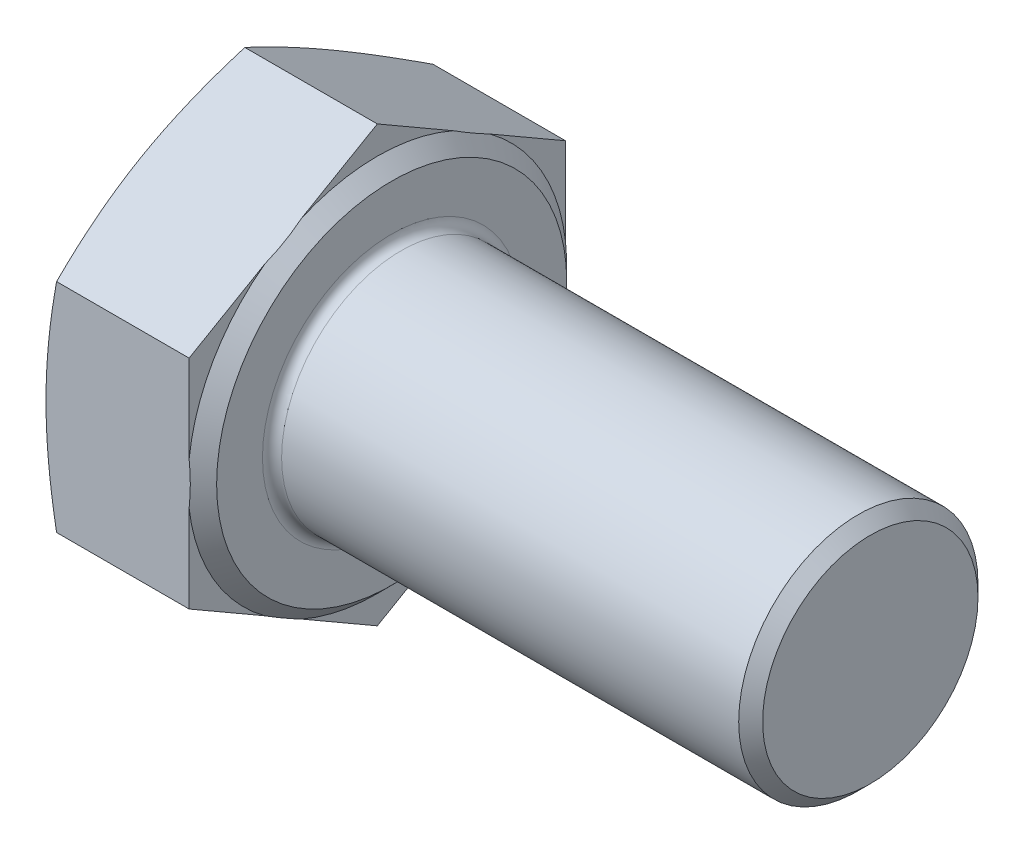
ISO-10303-21;
HEADER;
FILE_DESCRIPTION(('STEP AP214'),'2;1');
FILE_NAME('part.step','',(''),(''),'','','');
FILE_SCHEMA(('AUTOMOTIVE_DESIGN { 1 0 10303 214 1 1 1 1 }'));
ENDSEC;
DATA;
#1=APPLICATION_CONTEXT('core data for automotive mechanical design processes');
#2=APPLICATION_PROTOCOL_DEFINITION('international standard','automotive_design',2000,#1);
#3=PRODUCT_CONTEXT('',#1,'mechanical');
#4=PRODUCT('Part','Part','',(#3));
#5=PRODUCT_RELATED_PRODUCT_CATEGORY('part','',(#4));
#6=PRODUCT_DEFINITION_FORMATION('','',#4);
#7=PRODUCT_DEFINITION_CONTEXT('part definition',#1,'design');
#8=PRODUCT_DEFINITION('design','',#6,#7);
#9=PRODUCT_DEFINITION_SHAPE('','',#8);
#10=(LENGTH_UNIT() NAMED_UNIT(*) SI_UNIT(.MILLI.,.METRE.));
#11=(NAMED_UNIT(*) PLANE_ANGLE_UNIT() SI_UNIT($,.RADIAN.));
#12=(NAMED_UNIT(*) SI_UNIT($,.STERADIAN.) SOLID_ANGLE_UNIT());
#13=UNCERTAINTY_MEASURE_WITH_UNIT(LENGTH_MEASURE(1.E-05),#10,'distance_accuracy_value','');
#14=(GEOMETRIC_REPRESENTATION_CONTEXT(3) GLOBAL_UNCERTAINTY_ASSIGNED_CONTEXT((#13)) GLOBAL_UNIT_ASSIGNED_CONTEXT((#10,
#11,#12)) REPRESENTATION_CONTEXT('',''));
#15=CARTESIAN_POINT('',(0.,0.,0.));
#16=DIRECTION('',(0.,0.,1.));
#17=DIRECTION('',(1.,0.,0.));
#18=AXIS2_PLACEMENT_3D('',#15,#16,#17);
#19=CARTESIAN_POINT('',(6.58,-13.6225796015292,7.865));
#20=DIRECTION('',(-1.,0.,0.));
#21=DIRECTION('',(0.,0.,1.));
#22=AXIS2_PLACEMENT_3D('',#19,#20,#21);
#23=PLANE('',#22);
#24=CARTESIAN_POINT('',(6.58,0.,0.));
#25=DIRECTION('',(-1.,0.,0.));
#26=DIRECTION('',(0.,0.,1.));
#27=AXIS2_PLACEMENT_3D('',#24,#25,#26);
#28=CIRCLE('',#27,5.4);
#29=CARTESIAN_POINT('',(6.58,0.,5.4));
#30=VERTEX_POINT('',#29);
#31=EDGE_CURVE('E11',#30,#30,#28,.T.);
#32=ORIENTED_EDGE('',*,*,#31,.T.);
#33=EDGE_LOOP('',(#32));
#34=FACE_BOUND('',#33,.T.);
#35=CARTESIAN_POINT('',(6.58,0.,0.));
#36=DIRECTION('',(-1.,0.,0.));
#37=DIRECTION('',(0.,0.,1.));
#38=AXIS2_PLACEMENT_3D('',#35,#36,#37);
#39=CIRCLE('',#38,7.315);
#40=CARTESIAN_POINT('',(6.58,0.,7.315));
#41=VERTEX_POINT('',#40);
#42=EDGE_CURVE('E394',#41,#41,#39,.T.);
#43=ORIENTED_EDGE('',*,*,#42,.F.);
#44=EDGE_LOOP('',(#43));
#45=FACE_BOUND('',#44,.T.);
#46=ADVANCED_FACE('F34',(#34,#45),#23,.F.);
#47=CARTESIAN_POINT('',(6.58,-9.08171973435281,0.));
#48=DIRECTION('',(0.,0.866025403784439,0.5));
#49=DIRECTION('',(0.,-0.5,0.866025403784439));
#50=AXIS2_PLACEMENT_3D('',#47,#48,#49);
#51=PLANE('',#50);
#52=CARTESIAN_POINT('',(0.442891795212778,-4.54074439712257,-7.8652));
#53=CARTESIAN_POINT('',(0.374419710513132,-4.72880090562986,-7.53947657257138));
#54=CARTESIAN_POINT('',(0.31213253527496,-4.91747753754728,-7.21267905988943));
#55=CARTESIAN_POINT('',(0.202547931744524,-5.2960575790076,-6.55695919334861));
#56=CARTESIAN_POINT('',(0.155262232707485,-5.48596183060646,-6.22803538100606));
#57=CARTESIAN_POINT('',(0.0787789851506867,-5.86488964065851,-5.57171316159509));
#58=CARTESIAN_POINT('',(0.0494146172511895,-6.05390454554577,-5.24432974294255));
#59=CARTESIAN_POINT('',(0.0100287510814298,-6.43237636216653,-4.58879732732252));
#60=CARTESIAN_POINT('',(0.,-6.62183308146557,-4.26064866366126));
#61=CARTESIAN_POINT('',(0.,-7.00074652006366,-3.60435133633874));
#62=CARTESIAN_POINT('',(0.01002875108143,-7.1902032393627,-3.27620267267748));
#63=CARTESIAN_POINT('',(0.0494146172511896,-7.56867505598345,-2.62067025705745));
#64=CARTESIAN_POINT('',(0.0787789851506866,-7.75768996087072,-2.29328683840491));
#65=CARTESIAN_POINT('',(0.155262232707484,-8.13661777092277,-1.63696461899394));
#66=CARTESIAN_POINT('',(0.202547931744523,-8.32652202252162,-1.30804080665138));
#67=CARTESIAN_POINT('',(0.31213253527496,-8.70510206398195,-0.652320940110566));
#68=CARTESIAN_POINT('',(0.374419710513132,-8.89377869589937,-0.325523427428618));
#69=CARTESIAN_POINT('',(0.442891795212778,-9.08183520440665,0.000200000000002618));
#70=B_SPLINE_CURVE_WITH_KNOTS('',3,(#52,#53,#54,#55,#56,#57,#58,#59,#60,#61,#62,#63,#64,#65,#66,
#67,#68,#69),.UNSPECIFIED.,.F.,.F.,(4,2,2,2,2,2,2,2,4),(0.,1.14700314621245,2.29490090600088,
3.43194374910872,4.56856000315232,5.70517625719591,6.84221910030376,7.99011686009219,
9.13712000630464),.UNSPECIFIED.);
#71=CARTESIAN_POINT('',(0.442849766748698,-4.54085986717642,-7.865));
#72=VERTEX_POINT('',#71);
#73=CARTESIAN_POINT('',(0.,-6.81128980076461,-3.9325));
#74=VERTEX_POINT('',#73);
#75=EDGE_CURVE('E150',#72,#74,#70,.T.);
#76=ORIENTED_EDGE('',*,*,#75,.F.);
#77=DIRECTION('',(-1.,0.,0.));
#78=VECTOR('',#77,1.);
#79=CARTESIAN_POINT('',(6.58,-4.54085986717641,-7.865));
#80=LINE('',#79,#78);
#81=CARTESIAN_POINT('',(5.98,-4.54085986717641,-7.865));
#82=VERTEX_POINT('',#81);
#83=EDGE_CURVE('E179',#82,#72,#80,.T.);
#84=ORIENTED_EDGE('',*,*,#83,.F.);
#85=DIRECTION('',(0.,0.5,-0.866025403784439));
#86=VECTOR('',#85,1.);
#87=CARTESIAN_POINT('',(5.98,-9.08171973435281,0.));
#88=LINE('',#87,#86);
#89=CARTESIAN_POINT('',(5.98,-6.36716144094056,-4.7017528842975));
#90=VERTEX_POINT('',#89);
#91=EDGE_CURVE('E360',#90,#82,#88,.T.);
#92=ORIENTED_EDGE('',*,*,#91,.F.);
#93=CARTESIAN_POINT('',(5.9798,-7.25630835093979,-3.16170526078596));
#94=CARTESIAN_POINT('',(5.99646670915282,-7.18233435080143,-3.2898319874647));
#95=CARTESIAN_POINT('',(6.00903010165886,-7.10812502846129,-3.41836630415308));
#96=CARTESIAN_POINT('',(6.02578356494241,-6.95970657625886,-3.67543460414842));
#97=CARTESIAN_POINT('',(6.03,-6.88549818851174,-3.80396730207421));
#98=CARTESIAN_POINT('',(6.03,-6.73708141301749,-4.06103269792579));
#99=CARTESIAN_POINT('',(6.02578356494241,-6.66287302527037,-4.18956539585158));
#100=CARTESIAN_POINT('',(6.00903010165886,-6.51445457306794,-4.44663369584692));
#101=CARTESIAN_POINT('',(5.99646670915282,-6.44024525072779,-4.5751680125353));
#102=CARTESIAN_POINT('',(5.9798,-6.36627125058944,-4.70329473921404));
#103=B_SPLINE_CURVE_WITH_KNOTS('',3,(#93,#94,#95,#96,#97,#98,#99,#100,#101,#102),.UNSPECIFIED.,
.F.,.F.,(4,2,2,2,4),(0.,0.446607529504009,0.891802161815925,1.33699679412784,1.78360432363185),.UNSPECIFIED.);
#104=CARTESIAN_POINT('',(5.98,-7.25541816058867,-3.1632471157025));
#105=VERTEX_POINT('',#104);
#106=EDGE_CURVE('E298',#105,#90,#103,.T.);
#107=ORIENTED_EDGE('',*,*,#106,.F.);
#108=CARTESIAN_POINT('',(5.98,-9.08171973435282,0.));
#109=VERTEX_POINT('',#108);
#110=EDGE_CURVE('E364',#109,#105,#88,.T.);
#111=ORIENTED_EDGE('',*,*,#110,.F.);
#112=DIRECTION('',(-1.,0.,0.));
#113=VECTOR('',#112,1.);
#114=CARTESIAN_POINT('',(6.58,-9.08171973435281,0.));
#115=LINE('',#114,#113);
#116=CARTESIAN_POINT('',(0.442849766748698,-9.08171973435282,0.));
#117=VERTEX_POINT('',#116);
#118=EDGE_CURVE('E173',#109,#117,#115,.T.);
#119=ORIENTED_EDGE('',*,*,#118,.T.);
#120=EDGE_CURVE('E267',#74,#117,#70,.T.);
#121=ORIENTED_EDGE('',*,*,#120,.F.);
#122=EDGE_LOOP('',(#76,#84,#92,#107,#111,#119,#121));
#123=FACE_BOUND('',#122,.T.);
#124=ADVANCED_FACE('F36',(#123),#51,.F.);
#125=CARTESIAN_POINT('',(6.58,-4.54085986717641,-7.865));
#126=DIRECTION('',(0.,0.,1.));
#127=DIRECTION('',(1.,0.,0.));
#128=AXIS2_PLACEMENT_3D('',#125,#126,#127);
#129=PLANE('',#128);
#130=CARTESIAN_POINT('',(2.36641352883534,-12.0226002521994,-7.865));
#131=CARTESIAN_POINT('',(2.2580600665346,-11.6667592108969,-7.865));
#132=CARTESIAN_POINT('',(2.15097094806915,-11.3105260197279,-7.865));
#133=CARTESIAN_POINT('',(1.94002083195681,-10.5970756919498,-7.865));
#134=CARTESIAN_POINT('',(1.83616008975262,-10.2398584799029,-7.865));
#135=CARTESIAN_POINT('',(1.63219338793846,-9.52362904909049,-7.865));
#136=CARTESIAN_POINT('',(1.53209479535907,-9.16461472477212,-7.865));
#137=CARTESIAN_POINT('',(1.33682427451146,-8.44525058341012,-7.865));
#138=CARTESIAN_POINT('',(1.24165225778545,-8.08490079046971,-7.865));
#139=CARTESIAN_POINT('',(1.05859053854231,-7.36707846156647,-7.865));
#140=CARTESIAN_POINT('',(0.970625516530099,-7.00962522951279,-7.865));
#141=CARTESIAN_POINT('',(0.802184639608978,-6.29294003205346,-7.865));
#142=CARTESIAN_POINT('',(0.721708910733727,-5.93370803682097,-7.865));
#143=CARTESIAN_POINT('',(0.570122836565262,-5.21338493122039,-7.865));
#144=CARTESIAN_POINT('',(0.499009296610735,-4.85229449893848,-7.865));
#145=CARTESIAN_POINT('',(0.368312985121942,-4.12801725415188,-7.865));
#146=CARTESIAN_POINT('',(0.308729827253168,-3.76483051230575,-7.865));
#147=CARTESIAN_POINT('',(0.209414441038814,-3.07725690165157,-7.865));
#148=CARTESIAN_POINT('',(0.168205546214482,-2.7530853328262,-7.865));
#149=CARTESIAN_POINT('',(0.0984487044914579,-2.10337143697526,-7.865));
#150=CARTESIAN_POINT('',(0.0699003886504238,-1.77782915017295,-7.865));
#151=CARTESIAN_POINT('',(0.0268395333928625,-1.12603413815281,-7.865));
#152=CARTESIAN_POINT('',(0.0123170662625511,-0.799782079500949,-7.865));
#153=CARTESIAN_POINT('',(-0.00195682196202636,-0.14695155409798,-7.865));
#154=CARTESIAN_POINT('',(-0.00170834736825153,0.179626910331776,-7.865));
#155=CARTESIAN_POINT('',(0.013584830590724,0.834088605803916,-7.865));
#156=CARTESIAN_POINT('',(0.0287045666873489,1.1619700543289,-7.865));
#157=CARTESIAN_POINT('',(0.0730444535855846,1.81676988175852,-7.865));
#158=CARTESIAN_POINT('',(0.102264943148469,2.14368823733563,-7.865));
#159=CARTESIAN_POINT('',(0.173439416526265,2.79640045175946,-7.865));
#160=CARTESIAN_POINT('',(0.215404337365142,3.12219310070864,-7.865));
#161=CARTESIAN_POINT('',(0.310365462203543,3.77214853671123,-7.865));
#162=CARTESIAN_POINT('',(0.36336172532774,4.09631131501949,-7.865));
#163=CARTESIAN_POINT('',(0.48171036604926,4.76006524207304,-7.865));
#164=CARTESIAN_POINT('',(0.54756804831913,5.09956549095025,-7.865));
#165=CARTESIAN_POINT('',(0.68775969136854,5.77682257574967,-7.865));
#166=CARTESIAN_POINT('',(0.762094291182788,6.11457927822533,-7.865));
#167=CARTESIAN_POINT('',(0.91767888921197,6.78858995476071,-7.865));
#168=CARTESIAN_POINT('',(0.998930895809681,7.12484346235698,-7.865));
#169=CARTESIAN_POINT('',(1.16702859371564,7.79593398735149,-7.865));
#170=CARTESIAN_POINT('',(1.25387415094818,8.1307710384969,-7.865));
#171=CARTESIAN_POINT('',(1.43222777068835,8.79965725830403,-7.865));
#172=CARTESIAN_POINT('',(1.52374167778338,9.13370486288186,-7.865));
#173=CARTESIAN_POINT('',(1.71049239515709,9.80075635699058,-7.865));
#174=CARTESIAN_POINT('',(1.80572922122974,10.1337602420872,-7.865));
#175=CARTESIAN_POINT('',(1.99924297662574,10.7988194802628,-7.865));
#176=CARTESIAN_POINT('',(2.09751937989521,11.1308749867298,-7.865));
#177=CARTESIAN_POINT('',(2.29660417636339,11.7942269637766,-7.865));
#178=CARTESIAN_POINT('',(2.39741258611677,12.1255234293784,-7.865));
#179=CARTESIAN_POINT('',(2.7007312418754,13.1111316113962,-7.865));
#180=CARTESIAN_POINT('',(2.90629348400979,13.7645038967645,-7.865));
#181=CARTESIAN_POINT('',(3.32324319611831,15.0694121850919,-7.865));
#182=CARTESIAN_POINT('',(3.53463094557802,15.7209480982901,-7.865));
#183=CARTESIAN_POINT('',(3.96086805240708,17.0201471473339,-7.865));
#184=CARTESIAN_POINT('',(4.17570123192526,17.6678155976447,-7.865));
#185=CARTESIAN_POINT('',(4.50033413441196,18.6384901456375,-7.865));
#186=CARTESIAN_POINT('',(4.60893786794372,18.9618972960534,-7.865));
#187=CARTESIAN_POINT('',(4.82684807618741,19.6084739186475,-7.865));
#188=CARTESIAN_POINT('',(4.93615454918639,19.9316433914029,-7.865));
#189=CARTESIAN_POINT('',(5.04576544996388,20.2547096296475,-7.865));
#190=B_SPLINE_CURVE_WITH_KNOTS('',3,(#130,#131,#132,#133,#134,#135,#136,#137,#138,#139,#140,
#141,#142,#143,#144,#145,#146,#147,#148,#149,#150,#151,#152,#153,#154,#155,#156,#157,#158,#159,
#160,#161,#162,#163,#164,#165,#166,#167,#168,#169,#170,#171,#172,#173,#174,#175,#176,#177,#178,
#179,#180,#181,#182,#183,#184,#185,#186,#187,#188,#189),.UNSPECIFIED.,.F.,.F.,(4,2,2,2,2,2,2,2,
2,2,2,2,2,2,2,2,2,2,2,2,2,2,2,2,2,2,2,2,2,4),(0.,1.11592451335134,2.23193709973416,
3.35003188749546,4.46810659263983,5.57239601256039,6.67670401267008,7.78063420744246,
8.88452740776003,9.86465314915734,10.8447503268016,11.8241532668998,12.8035492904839,
13.7879123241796,14.7722990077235,15.7575328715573,16.7427720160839,17.78012614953,
18.8175585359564,19.8552931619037,20.8930029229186,21.9320453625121,22.971092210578,
24.0099602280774,25.0488350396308,27.1036289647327,29.1585216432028,31.2056173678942,
32.2290827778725,33.2525456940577),.UNSPECIFIED.);
#191=CARTESIAN_POINT('',(0.442849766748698,4.54085986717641,-7.865));
#192=VERTEX_POINT('',#191);
#193=CARTESIAN_POINT('',(0.,0.,-7.865));
#194=VERTEX_POINT('',#193);
#195=EDGE_CURVE('E278',#192,#194,#190,.F.);
#196=ORIENTED_EDGE('',*,*,#195,.F.);
#197=DIRECTION('',(-1.,0.,0.));
#198=VECTOR('',#197,1.);
#199=CARTESIAN_POINT('',(6.58,4.54085986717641,-7.865));
#200=LINE('',#199,#198);
#201=CARTESIAN_POINT('',(5.98,4.54085986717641,-7.865));
#202=VERTEX_POINT('',#201);
#203=EDGE_CURVE('E170',#202,#192,#200,.T.);
#204=ORIENTED_EDGE('',*,*,#203,.F.);
#205=DIRECTION('',(0.,1.,0.));
#206=VECTOR('',#205,1.);
#207=CARTESIAN_POINT('',(5.98,-4.54085986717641,-7.865));
#208=LINE('',#207,#206);
#209=CARTESIAN_POINT('',(5.98,0.888256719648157,-7.865));
#210=VERTEX_POINT('',#209);
#211=EDGE_CURVE('E357',#210,#202,#208,.T.);
#212=ORIENTED_EDGE('',*,*,#211,.F.);
#213=CARTESIAN_POINT('',(4.95281448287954,-4.25493323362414,-7.865));
#214=CARTESIAN_POINT('',(5.07224674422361,-4.0038176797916,-7.865));
#215=CARTESIAN_POINT('',(5.1852007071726,-3.74935435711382,-7.865));
#216=CARTESIAN_POINT('',(5.39477690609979,-3.23290692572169,-7.865));
#217=CARTESIAN_POINT('',(5.49134731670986,-2.97090190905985,-7.865));
#218=CARTESIAN_POINT('',(5.66341320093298,-2.44188823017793,-7.865));
#219=CARTESIAN_POINT('',(5.7390458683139,-2.17492499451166,-7.865));
#220=CARTESIAN_POINT('',(5.86601117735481,-1.6355184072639,-7.865));
#221=CARTESIAN_POINT('',(5.91737529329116,-1.36308263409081,-7.865));
#222=CARTESIAN_POINT('',(5.98170365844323,-0.894044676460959,-7.865));
#223=CARTESIAN_POINT('',(6.0014844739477,-0.698365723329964,-7.865));
#224=CARTESIAN_POINT('',(6.02648132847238,-0.306035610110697,-7.865));
#225=CARTESIAN_POINT('',(6.03169564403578,-0.109384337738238,-7.865));
#226=CARTESIAN_POINT('',(6.02733646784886,0.283885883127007,-7.865));
#227=CARTESIAN_POINT('',(6.01775297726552,0.480504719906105,-7.865));
#228=CARTESIAN_POINT('',(5.98416907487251,0.872456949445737,-7.865));
#229=CARTESIAN_POINT('',(5.96017040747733,1.06779049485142,-7.865));
#230=CARTESIAN_POINT('',(5.88319291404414,1.55355431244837,-7.865));
#231=CARTESIAN_POINT('',(5.82172156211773,1.84265691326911,-7.865));
#232=CARTESIAN_POINT('',(5.67244236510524,2.41426382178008,-7.865));
#233=CARTESIAN_POINT('',(5.58459433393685,2.69675734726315,-7.865));
#234=CARTESIAN_POINT('',(5.38697042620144,3.25528983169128,-7.865));
#235=CARTESIAN_POINT('',(5.27709906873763,3.53129462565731,-7.865));
#236=CARTESIAN_POINT('',(5.09956194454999,3.93908690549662,-7.865));
#237=CARTESIAN_POINT('',(5.03837569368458,4.07375872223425,-7.865));
#238=CARTESIAN_POINT('',(4.91219062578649,4.34125726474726,-7.865));
#239=CARTESIAN_POINT('',(4.8471929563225,4.47408453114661,-7.865));
#240=CARTESIAN_POINT('',(4.78050524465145,4.60606010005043,-7.865));
#241=B_SPLINE_CURVE_WITH_KNOTS('',3,(#213,#214,#215,#216,#217,#218,#219,#220,#221,#222,#223,
#224,#225,#226,#227,#228,#229,#230,#231,#232,#233,#234,#235,#236,#237,#238,#239,#240),
.UNSPECIFIED.,.F.,.F.,(4,2,2,2,2,2,2,2,2,2,2,2,2,4),(0.,0.834481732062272,1.67155582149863,
2.50300768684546,3.33337824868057,3.92290979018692,4.51251108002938,5.10251093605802,
5.69243940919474,6.57758291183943,7.46408187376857,8.35451073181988,8.7982229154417,
9.24180218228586),.UNSPECIFIED.);
#242=CARTESIAN_POINT('',(5.98,-0.888256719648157,-7.865));
#243=VERTEX_POINT('',#242);
#244=EDGE_CURVE('E292',#243,#210,#241,.T.);
#245=ORIENTED_EDGE('',*,*,#244,.F.);
#246=EDGE_CURVE('E358',#82,#243,#208,.T.);
#247=ORIENTED_EDGE('',*,*,#246,.F.);
#248=ORIENTED_EDGE('',*,*,#83,.T.);
#249=EDGE_CURVE('E161',#194,#72,#190,.F.);
#250=ORIENTED_EDGE('',*,*,#249,.F.);
#251=EDGE_LOOP('',(#196,#204,#212,#245,#247,#248,#250));
#252=FACE_BOUND('',#251,.T.);
#253=ADVANCED_FACE('F217',(#252),#129,.F.);
#254=CARTESIAN_POINT('',(6.58,4.54085986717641,-7.865));
#255=DIRECTION('',(0.,-0.866025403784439,0.5));
#256=DIRECTION('',(0.,-0.5,-0.866025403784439));
#257=AXIS2_PLACEMENT_3D('',#254,#255,#256);
#258=PLANE('',#257);
#259=CARTESIAN_POINT('',(0.442891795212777,9.08183520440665,0.000199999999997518));
#260=CARTESIAN_POINT('',(0.374419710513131,8.89377869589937,-0.325523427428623));
#261=CARTESIAN_POINT('',(0.31213253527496,8.70510206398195,-0.652320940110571));
#262=CARTESIAN_POINT('',(0.202547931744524,8.32652202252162,-1.30804080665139));
#263=CARTESIAN_POINT('',(0.155262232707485,8.13661777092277,-1.63696461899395));
#264=CARTESIAN_POINT('',(0.0787789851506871,7.75768996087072,-2.29328683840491));
#265=CARTESIAN_POINT('',(0.0494146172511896,7.56867505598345,-2.62067025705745));
#266=CARTESIAN_POINT('',(0.01002875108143,7.1902032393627,-3.27620267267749));
#267=CARTESIAN_POINT('',(0.,7.00074652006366,-3.60435133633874));
#268=CARTESIAN_POINT('',(0.,6.62183308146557,-4.26064866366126));
#269=CARTESIAN_POINT('',(0.0100287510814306,6.43237636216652,-4.58879732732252));
#270=CARTESIAN_POINT('',(0.0494146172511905,6.05390454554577,-5.24432974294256));
#271=CARTESIAN_POINT('',(0.0787789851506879,5.86488964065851,-5.57171316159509));
#272=CARTESIAN_POINT('',(0.155262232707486,5.48596183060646,-6.22803538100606));
#273=CARTESIAN_POINT('',(0.202547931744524,5.2960575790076,-6.55695919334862));
#274=CARTESIAN_POINT('',(0.31213253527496,4.91747753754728,-7.21267905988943));
#275=CARTESIAN_POINT('',(0.374419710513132,4.72880090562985,-7.53947657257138));
#276=CARTESIAN_POINT('',(0.442891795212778,4.54074439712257,-7.8652));
#277=B_SPLINE_CURVE_WITH_KNOTS('',3,(#259,#260,#261,#262,#263,#264,#265,#266,#267,#268,#269,
#270,#271,#272,#273,#274,#275,#276),.UNSPECIFIED.,.F.,.F.,(4,2,2,2,2,2,2,2,4),(0.,
1.14700314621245,2.29490090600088,3.43194374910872,4.56856000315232,5.70517625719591,
6.84221910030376,7.99011686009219,9.13712000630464),.UNSPECIFIED.);
#278=CARTESIAN_POINT('',(0.442849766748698,9.08171973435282,0.));
#279=VERTEX_POINT('',#278);
#280=CARTESIAN_POINT('',(0.,6.81128980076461,-3.9325));
#281=VERTEX_POINT('',#280);
#282=EDGE_CURVE('E339',#279,#281,#277,.T.);
#283=ORIENTED_EDGE('',*,*,#282,.F.);
#284=DIRECTION('',(-1.,0.,0.));
#285=VECTOR('',#284,1.);
#286=CARTESIAN_POINT('',(6.58,9.08171973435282,0.));
#287=LINE('',#286,#285);
#288=CARTESIAN_POINT('',(5.98,9.08171973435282,0.));
#289=VERTEX_POINT('',#288);
#290=EDGE_CURVE('E167',#289,#279,#287,.T.);
#291=ORIENTED_EDGE('',*,*,#290,.F.);
#292=DIRECTION('',(0.,0.5,0.866025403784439));
#293=VECTOR('',#292,1.);
#294=CARTESIAN_POINT('',(5.98,4.54085986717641,-7.865));
#295=LINE('',#294,#293);
#296=CARTESIAN_POINT('',(5.98,7.25541816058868,-3.16324711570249));
#297=VERTEX_POINT('',#296);
#298=EDGE_CURVE('E349',#297,#289,#295,.T.);
#299=ORIENTED_EDGE('',*,*,#298,.F.);
#300=CARTESIAN_POINT('',(5.9798,6.36627125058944,-4.70329473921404));
#301=CARTESIAN_POINT('',(5.99646670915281,6.4402452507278,-4.5751680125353));
#302=CARTESIAN_POINT('',(6.00903010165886,6.51445457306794,-4.44663369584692));
#303=CARTESIAN_POINT('',(6.0257835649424,6.66287302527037,-4.18956539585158));
#304=CARTESIAN_POINT('',(6.03,6.73708141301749,-4.06103269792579));
#305=CARTESIAN_POINT('',(6.03,6.88549818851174,-3.80396730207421));
#306=CARTESIAN_POINT('',(6.02578356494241,6.95970657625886,-3.67543460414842));
#307=CARTESIAN_POINT('',(6.00903010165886,7.10812502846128,-3.41836630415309));
#308=CARTESIAN_POINT('',(5.99646670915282,7.18233435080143,-3.28983198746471));
#309=CARTESIAN_POINT('',(5.9798,7.25630835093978,-3.16170526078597));
#310=B_SPLINE_CURVE_WITH_KNOTS('',3,(#300,#301,#302,#303,#304,#305,#306,#307,#308,#309),
.UNSPECIFIED.,.F.,.F.,(4,2,2,2,4),(0.,0.446607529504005,0.891802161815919,1.33699679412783,
1.78360432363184),.UNSPECIFIED.);
#311=CARTESIAN_POINT('',(5.98,6.36716144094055,-4.70175288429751));
#312=VERTEX_POINT('',#311);
#313=EDGE_CURVE('E299',#312,#297,#310,.T.);
#314=ORIENTED_EDGE('',*,*,#313,.F.);
#315=EDGE_CURVE('E352',#202,#312,#295,.T.);
#316=ORIENTED_EDGE('',*,*,#315,.F.);
#317=ORIENTED_EDGE('',*,*,#203,.T.);
#318=EDGE_CURVE('E279',#281,#192,#277,.T.);
#319=ORIENTED_EDGE('',*,*,#318,.F.);
#320=EDGE_LOOP('',(#283,#291,#299,#314,#316,#317,#319));
#321=FACE_BOUND('',#320,.T.);
#322=ADVANCED_FACE('F287',(#321),#258,.F.);
#323=CARTESIAN_POINT('',(6.58,9.08171973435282,0.));
#324=DIRECTION('',(0.,-0.866025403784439,-0.5));
#325=DIRECTION('',(0.,0.5,-0.866025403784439));
#326=AXIS2_PLACEMENT_3D('',#323,#324,#325);
#327=PLANE('',#326);
#328=CARTESIAN_POINT('',(0.442891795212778,4.54074439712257,7.8652));
#329=CARTESIAN_POINT('',(0.374419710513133,4.72880090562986,7.53947657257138));
#330=CARTESIAN_POINT('',(0.312132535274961,4.91747753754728,7.21267905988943));
#331=CARTESIAN_POINT('',(0.202547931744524,5.2960575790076,6.55695919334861));
#332=CARTESIAN_POINT('',(0.155262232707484,5.48596183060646,6.22803538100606));
#333=CARTESIAN_POINT('',(0.0787789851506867,5.86488964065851,5.57171316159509));
#334=CARTESIAN_POINT('',(0.0494146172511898,6.05390454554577,5.24432974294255));
#335=CARTESIAN_POINT('',(0.0100287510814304,6.43237636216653,4.58879732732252));
#336=CARTESIAN_POINT('',(0.,6.62183308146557,4.26064866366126));
#337=CARTESIAN_POINT('',(0.,7.00074652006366,3.60435133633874));
#338=CARTESIAN_POINT('',(0.0100287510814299,7.1902032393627,3.27620267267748));
#339=CARTESIAN_POINT('',(0.0494146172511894,7.56867505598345,2.62067025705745));
#340=CARTESIAN_POINT('',(0.0787789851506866,7.75768996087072,2.29328683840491));
#341=CARTESIAN_POINT('',(0.155262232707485,8.13661777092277,1.63696461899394));
#342=CARTESIAN_POINT('',(0.202547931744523,8.32652202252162,1.30804080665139));
#343=CARTESIAN_POINT('',(0.31213253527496,8.70510206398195,0.652320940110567));
#344=CARTESIAN_POINT('',(0.374419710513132,8.89377869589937,0.325523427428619));
#345=CARTESIAN_POINT('',(0.442891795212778,9.08183520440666,-0.000200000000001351));
#346=B_SPLINE_CURVE_WITH_KNOTS('',3,(#328,#329,#330,#331,#332,#333,#334,#335,#336,#337,#338,
#339,#340,#341,#342,#343,#344,#345),.UNSPECIFIED.,.F.,.F.,(4,2,2,2,2,2,2,2,4),(0.,
1.14700314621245,2.29490090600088,3.43194374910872,4.56856000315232,5.70517625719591,
6.84221910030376,7.99011686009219,9.13712000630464),.UNSPECIFIED.);
#347=CARTESIAN_POINT('',(0.442849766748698,4.54085986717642,7.865));
#348=VERTEX_POINT('',#347);
#349=CARTESIAN_POINT('',(0.,6.81128980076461,3.9325));
#350=VERTEX_POINT('',#349);
#351=EDGE_CURVE('E145',#348,#350,#346,.T.);
#352=ORIENTED_EDGE('',*,*,#351,.F.);
#353=DIRECTION('',(-1.,0.,0.));
#354=VECTOR('',#353,1.);
#355=CARTESIAN_POINT('',(6.58,4.54085986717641,7.865));
#356=LINE('',#355,#354);
#357=CARTESIAN_POINT('',(5.98,4.54085986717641,7.865));
#358=VERTEX_POINT('',#357);
#359=EDGE_CURVE('E158',#358,#348,#356,.T.);
#360=ORIENTED_EDGE('',*,*,#359,.F.);
#361=DIRECTION('',(0.,-0.5,0.866025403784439));
#362=VECTOR('',#361,1.);
#363=CARTESIAN_POINT('',(5.98,9.08171973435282,0.));
#364=LINE('',#363,#362);
#365=CARTESIAN_POINT('',(5.98,6.36716144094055,4.70175288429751));
#366=VERTEX_POINT('',#365);
#367=EDGE_CURVE('E350',#366,#358,#364,.T.);
#368=ORIENTED_EDGE('',*,*,#367,.F.);
#369=CARTESIAN_POINT('',(5.9798,7.25630835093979,3.16170526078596));
#370=CARTESIAN_POINT('',(5.99646670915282,7.18233435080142,3.28983198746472));
#371=CARTESIAN_POINT('',(6.00903010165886,7.10812502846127,3.41836630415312));
#372=CARTESIAN_POINT('',(6.02578356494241,6.95970657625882,3.67543460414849));
#373=CARTESIAN_POINT('',(6.03,6.88549818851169,3.8039673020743));
#374=CARTESIAN_POINT('',(6.03,6.73708141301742,4.06103269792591));
#375=CARTESIAN_POINT('',(6.0257835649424,6.66287302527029,4.18956539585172));
#376=CARTESIAN_POINT('',(6.00903010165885,6.51445457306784,4.44663369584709));
#377=CARTESIAN_POINT('',(5.9964667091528,6.44024525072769,4.57516801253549));
#378=CARTESIAN_POINT('',(5.97979999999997,6.36627125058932,4.70329473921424));
#379=B_SPLINE_CURVE_WITH_KNOTS('',3,(#369,#370,#371,#372,#373,#374,#375,#376,#377,#378),
.UNSPECIFIED.,.F.,.F.,(4,2,2,2,4),(0.,0.446607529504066,0.89180216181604,1.33699679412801,
1.78360432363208),.UNSPECIFIED.);
#380=CARTESIAN_POINT('',(5.98,7.25541816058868,3.16324711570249));
#381=VERTEX_POINT('',#380);
#382=EDGE_CURVE('E322',#381,#366,#379,.T.);
#383=ORIENTED_EDGE('',*,*,#382,.F.);
#384=EDGE_CURVE('E345',#289,#381,#364,.T.);
#385=ORIENTED_EDGE('',*,*,#384,.F.);
#386=ORIENTED_EDGE('',*,*,#290,.T.);
#387=EDGE_CURVE('E160',#350,#279,#346,.T.);
#388=ORIENTED_EDGE('',*,*,#387,.F.);
#389=EDGE_LOOP('',(#352,#360,#368,#383,#385,#386,#388));
#390=FACE_BOUND('',#389,.T.);
#391=ADVANCED_FACE('F156',(#390),#327,.F.);
#392=CARTESIAN_POINT('',(6.58,4.54085986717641,7.865));
#393=DIRECTION('',(0.,0.,-1.));
#394=DIRECTION('',(-1.,0.,0.));
#395=AXIS2_PLACEMENT_3D('',#392,#393,#394);
#396=PLANE('',#395);
#397=CARTESIAN_POINT('',(2.36641352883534,-12.0226002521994,7.865));
#398=CARTESIAN_POINT('',(2.2580600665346,-11.6667592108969,7.865));
#399=CARTESIAN_POINT('',(2.15097094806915,-11.3105260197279,7.865));
#400=CARTESIAN_POINT('',(1.94002083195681,-10.5970756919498,7.865));
#401=CARTESIAN_POINT('',(1.83616008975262,-10.2398584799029,7.865));
#402=CARTESIAN_POINT('',(1.63219338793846,-9.52362904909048,7.865));
#403=CARTESIAN_POINT('',(1.53209479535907,-9.16461472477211,7.865));
#404=CARTESIAN_POINT('',(1.33682427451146,-8.44525058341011,7.865));
#405=CARTESIAN_POINT('',(1.24165225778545,-8.0849007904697,7.865));
#406=CARTESIAN_POINT('',(1.0585905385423,-7.36707846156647,7.865));
#407=CARTESIAN_POINT('',(0.970625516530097,-7.00962522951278,7.865));
#408=CARTESIAN_POINT('',(0.802184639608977,-6.29294003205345,7.865));
#409=CARTESIAN_POINT('',(0.721708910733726,-5.93370803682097,7.865));
#410=CARTESIAN_POINT('',(0.570122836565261,-5.21338493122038,7.865));
#411=CARTESIAN_POINT('',(0.499009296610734,-4.85229449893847,7.865));
#412=CARTESIAN_POINT('',(0.368312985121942,-4.12801725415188,7.865));
#413=CARTESIAN_POINT('',(0.308729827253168,-3.76483051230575,7.865));
#414=CARTESIAN_POINT('',(0.209414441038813,-3.07725690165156,7.865));
#415=CARTESIAN_POINT('',(0.168205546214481,-2.75308533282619,7.865));
#416=CARTESIAN_POINT('',(0.0984487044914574,-2.10337143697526,7.865));
#417=CARTESIAN_POINT('',(0.0699003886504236,-1.77782915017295,7.865));
#418=CARTESIAN_POINT('',(0.0268395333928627,-1.1260341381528,7.865));
#419=CARTESIAN_POINT('',(0.0123170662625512,-0.799782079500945,7.865));
#420=CARTESIAN_POINT('',(-0.00195682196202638,-0.146951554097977,7.865));
#421=CARTESIAN_POINT('',(-0.00170834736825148,0.179626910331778,7.865));
#422=CARTESIAN_POINT('',(0.013584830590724,0.834088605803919,7.865));
#423=CARTESIAN_POINT('',(0.0287045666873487,1.1619700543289,7.865));
#424=CARTESIAN_POINT('',(0.0730444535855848,1.81676988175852,7.865));
#425=CARTESIAN_POINT('',(0.10226494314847,2.14368823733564,7.865));
#426=CARTESIAN_POINT('',(0.173439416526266,2.79640045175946,7.865));
#427=CARTESIAN_POINT('',(0.215404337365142,3.12219310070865,7.865));
#428=CARTESIAN_POINT('',(0.310365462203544,3.77214853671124,7.865));
#429=CARTESIAN_POINT('',(0.363361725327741,4.09631131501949,7.865));
#430=CARTESIAN_POINT('',(0.481710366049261,4.76006524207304,7.865));
#431=CARTESIAN_POINT('',(0.547568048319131,5.09956549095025,7.865));
#432=CARTESIAN_POINT('',(0.68775969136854,5.77682257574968,7.865));
#433=CARTESIAN_POINT('',(0.762094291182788,6.11457927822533,7.865));
#434=CARTESIAN_POINT('',(0.91767888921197,6.78858995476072,7.865));
#435=CARTESIAN_POINT('',(0.998930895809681,7.12484346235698,7.865));
#436=CARTESIAN_POINT('',(1.16702859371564,7.7959339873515,7.865));
#437=CARTESIAN_POINT('',(1.25387415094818,8.13077103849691,7.865));
#438=CARTESIAN_POINT('',(1.43222777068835,8.79965725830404,7.865));
#439=CARTESIAN_POINT('',(1.52374167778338,9.13370486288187,7.865));
#440=CARTESIAN_POINT('',(1.71049239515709,9.80075635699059,7.865));
#441=CARTESIAN_POINT('',(1.80572922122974,10.1337602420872,7.865));
#442=CARTESIAN_POINT('',(1.99924297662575,10.7988194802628,7.865));
#443=CARTESIAN_POINT('',(2.09751937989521,11.1308749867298,7.865));
#444=CARTESIAN_POINT('',(2.29660417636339,11.7942269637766,7.865));
#445=CARTESIAN_POINT('',(2.39741258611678,12.1255234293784,7.865));
#446=CARTESIAN_POINT('',(2.7007312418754,13.1111316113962,7.865));
#447=CARTESIAN_POINT('',(2.90629348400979,13.7645038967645,7.865));
#448=CARTESIAN_POINT('',(3.32324319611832,15.0694121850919,7.865));
#449=CARTESIAN_POINT('',(3.53463094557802,15.7209480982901,7.865));
#450=CARTESIAN_POINT('',(3.96086805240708,17.0201471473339,7.865));
#451=CARTESIAN_POINT('',(4.17570123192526,17.6678155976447,7.865));
#452=CARTESIAN_POINT('',(4.50033413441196,18.6384901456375,7.865));
#453=CARTESIAN_POINT('',(4.60893786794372,18.9618972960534,7.865));
#454=CARTESIAN_POINT('',(4.82684807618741,19.6084739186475,7.865));
#455=CARTESIAN_POINT('',(4.93615454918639,19.9316433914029,7.865));
#456=CARTESIAN_POINT('',(5.04576544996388,20.2547096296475,7.865));
#457=B_SPLINE_CURVE_WITH_KNOTS('',3,(#397,#398,#399,#400,#401,#402,#403,#404,#405,#406,#407,
#408,#409,#410,#411,#412,#413,#414,#415,#416,#417,#418,#419,#420,#421,#422,#423,#424,#425,#426,
#427,#428,#429,#430,#431,#432,#433,#434,#435,#436,#437,#438,#439,#440,#441,#442,#443,#444,#445,
#446,#447,#448,#449,#450,#451,#452,#453,#454,#455,#456),.UNSPECIFIED.,.F.,.F.,(4,2,2,2,2,2,2,2,
2,2,2,2,2,2,2,2,2,2,2,2,2,2,2,2,2,2,2,2,2,4),(0.,1.11592451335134,2.23193709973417,
3.35003188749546,4.46810659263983,5.5723960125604,6.67670401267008,7.78063420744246,
8.88452740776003,9.86465314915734,10.8447503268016,11.8241532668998,12.8035492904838,
13.7879123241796,14.7722990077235,15.7575328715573,16.7427720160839,17.78012614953,
18.8175585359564,19.8552931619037,20.8930029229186,21.9320453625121,22.971092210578,
24.0099602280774,25.0488350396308,27.1036289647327,29.1585216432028,31.2056173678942,
32.2290827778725,33.2525456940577),.UNSPECIFIED.);
#458=CARTESIAN_POINT('',(0.442849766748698,-4.5408598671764,7.86500000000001));
#459=VERTEX_POINT('',#458);
#460=CARTESIAN_POINT('',(0.,0.,7.865));
#461=VERTEX_POINT('',#460);
#462=EDGE_CURVE('E152',#459,#461,#457,.T.);
#463=ORIENTED_EDGE('',*,*,#462,.F.);
#464=DIRECTION('',(-1.,0.,0.));
#465=VECTOR('',#464,1.);
#466=CARTESIAN_POINT('',(6.58,-4.54085986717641,7.865));
#467=LINE('',#466,#465);
#468=CARTESIAN_POINT('',(5.98,-4.54085986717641,7.865));
#469=VERTEX_POINT('',#468);
#470=EDGE_CURVE('E168',#469,#459,#467,.T.);
#471=ORIENTED_EDGE('',*,*,#470,.F.);
#472=DIRECTION('',(0.,-1.,0.));
#473=VECTOR('',#472,1.);
#474=CARTESIAN_POINT('',(5.98,4.54085986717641,7.865));
#475=LINE('',#474,#473);
#476=CARTESIAN_POINT('',(5.98,-0.888256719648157,7.865));
#477=VERTEX_POINT('',#476);
#478=EDGE_CURVE('E355',#477,#469,#475,.T.);
#479=ORIENTED_EDGE('',*,*,#478,.F.);
#480=CARTESIAN_POINT('',(4.95281448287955,-4.25493323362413,7.865));
#481=CARTESIAN_POINT('',(5.07224674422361,-4.00381767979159,7.865));
#482=CARTESIAN_POINT('',(5.1852007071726,-3.74935435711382,7.865));
#483=CARTESIAN_POINT('',(5.3947769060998,-3.23290692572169,7.865));
#484=CARTESIAN_POINT('',(5.49134731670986,-2.97090190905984,7.865));
#485=CARTESIAN_POINT('',(5.66341320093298,-2.44188823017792,7.865));
#486=CARTESIAN_POINT('',(5.7390458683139,-2.17492499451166,7.865));
#487=CARTESIAN_POINT('',(5.86601117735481,-1.6355184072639,7.865));
#488=CARTESIAN_POINT('',(5.91737529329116,-1.36308263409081,7.865));
#489=CARTESIAN_POINT('',(5.98170365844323,-0.894044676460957,7.865));
#490=CARTESIAN_POINT('',(6.0014844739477,-0.698365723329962,7.865));
#491=CARTESIAN_POINT('',(6.02648132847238,-0.306035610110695,7.865));
#492=CARTESIAN_POINT('',(6.03169564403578,-0.109384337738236,7.865));
#493=CARTESIAN_POINT('',(6.02733646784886,0.283885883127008,7.865));
#494=CARTESIAN_POINT('',(6.01775297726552,0.480504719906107,7.865));
#495=CARTESIAN_POINT('',(5.98416907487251,0.87245694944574,7.865));
#496=CARTESIAN_POINT('',(5.96017040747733,1.06779049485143,7.865));
#497=CARTESIAN_POINT('',(5.88319291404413,1.55355431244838,7.865));
#498=CARTESIAN_POINT('',(5.82172156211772,1.84265691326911,7.865));
#499=CARTESIAN_POINT('',(5.67244236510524,2.41426382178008,7.865));
#500=CARTESIAN_POINT('',(5.58459433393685,2.69675734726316,7.865));
#501=CARTESIAN_POINT('',(5.38697042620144,3.25528983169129,7.865));
#502=CARTESIAN_POINT('',(5.27709906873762,3.53129462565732,7.865));
#503=CARTESIAN_POINT('',(5.09956194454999,3.93908690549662,7.865));
#504=CARTESIAN_POINT('',(5.03837569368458,4.07375872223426,7.865));
#505=CARTESIAN_POINT('',(4.91219062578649,4.34125726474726,7.865));
#506=CARTESIAN_POINT('',(4.8471929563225,4.47408453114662,7.865));
#507=CARTESIAN_POINT('',(4.78050524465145,4.60606010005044,7.865));
#508=B_SPLINE_CURVE_WITH_KNOTS('',3,(#480,#481,#482,#483,#484,#485,#486,#487,#488,#489,#490,
#491,#492,#493,#494,#495,#496,#497,#498,#499,#500,#501,#502,#503,#504,#505,#506,#507),
.UNSPECIFIED.,.F.,.F.,(4,2,2,2,2,2,2,2,2,2,2,2,2,4),(0.,0.834481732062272,1.67155582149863,
2.50300768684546,3.33337824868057,3.92290979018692,4.51251108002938,5.10251093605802,
5.69243940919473,6.57758291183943,7.46408187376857,8.35451073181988,8.79822291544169,
9.24180218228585),.UNSPECIFIED.);
#509=CARTESIAN_POINT('',(5.98,0.888256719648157,7.865));
#510=VERTEX_POINT('',#509);
#511=EDGE_CURVE('E317',#510,#477,#508,.F.);
#512=ORIENTED_EDGE('',*,*,#511,.F.);
#513=EDGE_CURVE('E166',#358,#510,#475,.T.);
#514=ORIENTED_EDGE('',*,*,#513,.F.);
#515=ORIENTED_EDGE('',*,*,#359,.T.);
#516=EDGE_CURVE('E142',#461,#348,#457,.T.);
#517=ORIENTED_EDGE('',*,*,#516,.F.);
#518=EDGE_LOOP('',(#463,#471,#479,#512,#514,#515,#517));
#519=FACE_BOUND('',#518,.T.);
#520=ADVANCED_FACE('F164',(#519),#396,.F.);
#521=CARTESIAN_POINT('',(6.58,-4.54085986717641,7.865));
#522=DIRECTION('',(0.,0.866025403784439,-0.5));
#523=DIRECTION('',(0.,0.5,0.866025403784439));
#524=AXIS2_PLACEMENT_3D('',#521,#522,#523);
#525=PLANE('',#524);
#526=CARTESIAN_POINT('',(0.442891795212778,-9.08183520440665,-0.000199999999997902));
#527=CARTESIAN_POINT('',(0.374419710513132,-8.89377869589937,0.325523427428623));
#528=CARTESIAN_POINT('',(0.31213253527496,-8.70510206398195,0.652320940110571));
#529=CARTESIAN_POINT('',(0.202547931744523,-8.32652202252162,1.30804080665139));
#530=CARTESIAN_POINT('',(0.155262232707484,-8.13661777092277,1.63696461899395));
#531=CARTESIAN_POINT('',(0.0787789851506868,-7.75768996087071,2.29328683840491));
#532=CARTESIAN_POINT('',(0.0494146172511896,-7.56867505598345,2.62067025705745));
#533=CARTESIAN_POINT('',(0.01002875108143,-7.1902032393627,3.27620267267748));
#534=CARTESIAN_POINT('',(0.,-7.00074652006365,3.60435133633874));
#535=CARTESIAN_POINT('',(0.,-6.62183308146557,4.26064866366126));
#536=CARTESIAN_POINT('',(0.0100287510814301,-6.43237636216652,4.58879732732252));
#537=CARTESIAN_POINT('',(0.0494146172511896,-6.05390454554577,5.24432974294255));
#538=CARTESIAN_POINT('',(0.0787789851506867,-5.86488964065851,5.57171316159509));
#539=CARTESIAN_POINT('',(0.155262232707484,-5.48596183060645,6.22803538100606));
#540=CARTESIAN_POINT('',(0.202547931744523,-5.2960575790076,6.55695919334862));
#541=CARTESIAN_POINT('',(0.31213253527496,-4.91747753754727,7.21267905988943));
#542=CARTESIAN_POINT('',(0.374419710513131,-4.72880090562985,7.53947657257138));
#543=CARTESIAN_POINT('',(0.442891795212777,-4.54074439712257,7.8652));
#544=B_SPLINE_CURVE_WITH_KNOTS('',3,(#526,#527,#528,#529,#530,#531,#532,#533,#534,#535,#536,
#537,#538,#539,#540,#541,#542,#543),.UNSPECIFIED.,.F.,.F.,(4,2,2,2,2,2,2,2,4),(0.,
1.14700314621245,2.29490090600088,3.43194374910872,4.56856000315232,5.70517625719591,
6.84221910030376,7.99011686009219,9.13712000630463),.UNSPECIFIED.);
#545=CARTESIAN_POINT('',(0.,-6.81128980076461,3.9325));
#546=VERTEX_POINT('',#545);
#547=EDGE_CURVE('E247',#117,#546,#544,.T.);
#548=ORIENTED_EDGE('',*,*,#547,.F.);
#549=ORIENTED_EDGE('',*,*,#118,.F.);
#550=DIRECTION('',(0.,-0.5,-0.866025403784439));
#551=VECTOR('',#550,1.);
#552=CARTESIAN_POINT('',(5.98,-4.54085986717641,7.865));
#553=LINE('',#552,#551);
#554=CARTESIAN_POINT('',(5.98,-7.25541816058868,3.16324711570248));
#555=VERTEX_POINT('',#554);
#556=EDGE_CURVE('E182',#555,#109,#553,.T.);
#557=ORIENTED_EDGE('',*,*,#556,.F.);
#558=CARTESIAN_POINT('',(5.97979999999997,-6.3662712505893,4.70329473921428));
#559=CARTESIAN_POINT('',(5.99646670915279,-6.44024525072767,4.57516801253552));
#560=CARTESIAN_POINT('',(6.00903010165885,-6.51445457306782,4.44663369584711));
#561=CARTESIAN_POINT('',(6.0257835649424,-6.66287302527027,4.18956539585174));
#562=CARTESIAN_POINT('',(6.03,-6.73708141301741,4.06103269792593));
#563=CARTESIAN_POINT('',(6.03000000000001,-6.88549818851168,3.8039673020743));
#564=CARTESIAN_POINT('',(6.02578356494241,-6.95970657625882,3.67543460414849));
#565=CARTESIAN_POINT('',(6.00903010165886,-7.10812502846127,3.41836630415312));
#566=CARTESIAN_POINT('',(5.99646670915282,-7.18233435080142,3.28983198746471));
#567=CARTESIAN_POINT('',(5.9798,-7.25630835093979,3.16170526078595));
#568=B_SPLINE_CURVE_WITH_KNOTS('',3,(#558,#559,#560,#561,#562,#563,#564,#565,#566,#567),
.UNSPECIFIED.,.F.,.F.,(4,2,2,2,4),(0.,0.44660752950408,0.891802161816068,1.33699679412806,
1.78360432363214),.UNSPECIFIED.);
#569=CARTESIAN_POINT('',(5.98,-6.36716144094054,4.70175288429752));
#570=VERTEX_POINT('',#569);
#571=EDGE_CURVE('E234',#570,#555,#568,.T.);
#572=ORIENTED_EDGE('',*,*,#571,.F.);
#573=EDGE_CURVE('E184',#469,#570,#553,.T.);
#574=ORIENTED_EDGE('',*,*,#573,.F.);
#575=ORIENTED_EDGE('',*,*,#470,.T.);
#576=EDGE_CURVE('E241',#546,#459,#544,.T.);
#577=ORIENTED_EDGE('',*,*,#576,.F.);
#578=EDGE_LOOP('',(#548,#549,#557,#572,#574,#575,#577));
#579=FACE_BOUND('',#578,.T.);
#580=ADVANCED_FACE('F224',(#579),#525,.F.);
#581=CARTESIAN_POINT('',(5.98,7.91500000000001,0.));
#582=DIRECTION('',(1.,0.,0.));
#583=DIRECTION('',(0.,0.,-1.));
#584=AXIS2_PLACEMENT_3D('',#581,#582,#583);
#585=PLANE('',#584);
#586=ORIENTED_EDGE('',*,*,#91,.T.);
#587=ORIENTED_EDGE('',*,*,#246,.T.);
#588=CARTESIAN_POINT('',(5.98,0.,0.));
#589=DIRECTION('',(-1.,0.,0.));
#590=DIRECTION('',(0.,0.,1.));
#591=AXIS2_PLACEMENT_3D('',#588,#589,#590);
#592=CIRCLE('',#591,7.91500000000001);
#593=EDGE_CURVE('E374',#243,#90,#592,.T.);
#594=ORIENTED_EDGE('',*,*,#593,.T.);
#595=EDGE_LOOP('',(#586,#587,#594));
#596=FACE_BOUND('',#595,.T.);
#597=ADVANCED_FACE('F228',(#596),#585,.T.);
#598=ORIENTED_EDGE('',*,*,#211,.T.);
#599=ORIENTED_EDGE('',*,*,#315,.T.);
#600=EDGE_CURVE('E378',#312,#210,#592,.T.);
#601=ORIENTED_EDGE('',*,*,#600,.T.);
#602=EDGE_LOOP('',(#598,#599,#601));
#603=FACE_BOUND('',#602,.T.);
#604=ADVANCED_FACE('F389',(#603),#585,.T.);
#605=ORIENTED_EDGE('',*,*,#298,.T.);
#606=ORIENTED_EDGE('',*,*,#384,.T.);
#607=EDGE_CURVE('E391',#381,#297,#592,.T.);
#608=ORIENTED_EDGE('',*,*,#607,.T.);
#609=EDGE_LOOP('',(#605,#606,#608));
#610=FACE_BOUND('',#609,.T.);
#611=ADVANCED_FACE('F418',(#610),#585,.T.);
#612=ORIENTED_EDGE('',*,*,#367,.T.);
#613=ORIENTED_EDGE('',*,*,#513,.T.);
#614=EDGE_CURVE('E392',#510,#366,#592,.T.);
#615=ORIENTED_EDGE('',*,*,#614,.T.);
#616=EDGE_LOOP('',(#612,#613,#615));
#617=FACE_BOUND('',#616,.T.);
#618=ADVANCED_FACE('F413',(#617),#585,.T.);
#619=ORIENTED_EDGE('',*,*,#478,.T.);
#620=ORIENTED_EDGE('',*,*,#573,.T.);
#621=EDGE_CURVE('E342',#570,#477,#592,.T.);
#622=ORIENTED_EDGE('',*,*,#621,.T.);
#623=EDGE_LOOP('',(#619,#620,#622));
#624=FACE_BOUND('',#623,.T.);
#625=ADVANCED_FACE('F404',(#624),#585,.T.);
#626=ORIENTED_EDGE('',*,*,#110,.T.);
#627=EDGE_CURVE('E377',#105,#555,#592,.T.);
#628=ORIENTED_EDGE('',*,*,#627,.T.);
#629=ORIENTED_EDGE('',*,*,#556,.T.);
#630=EDGE_LOOP('',(#626,#628,#629));
#631=FACE_BOUND('',#630,.T.);
#632=ADVANCED_FACE('F311',(#631),#585,.T.);
#633=CARTESIAN_POINT('',(5.98,0.,0.));
#634=DIRECTION('',(-1.,0.,0.));
#635=DIRECTION('',(0.,0.,1.));
#636=AXIS2_PLACEMENT_3D('',#633,#634,#635);
#637=CONICAL_SURFACE('',#636,7.91500000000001,0.785398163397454);
#638=ORIENTED_EDGE('',*,*,#42,.T.);
#639=EDGE_LOOP('',(#638));
#640=FACE_BOUND('',#639,.T.);
#641=ORIENTED_EDGE('',*,*,#106,.T.);
#642=ORIENTED_EDGE('',*,*,#593,.F.);
#643=ORIENTED_EDGE('',*,*,#244,.T.);
#644=ORIENTED_EDGE('',*,*,#600,.F.);
#645=ORIENTED_EDGE('',*,*,#313,.T.);
#646=ORIENTED_EDGE('',*,*,#607,.F.);
#647=ORIENTED_EDGE('',*,*,#382,.T.);
#648=ORIENTED_EDGE('',*,*,#614,.F.);
#649=ORIENTED_EDGE('',*,*,#511,.T.);
#650=ORIENTED_EDGE('',*,*,#621,.F.);
#651=ORIENTED_EDGE('',*,*,#571,.T.);
#652=ORIENTED_EDGE('',*,*,#627,.F.);
#653=EDGE_LOOP('',(#641,#642,#643,#644,#645,#646,#647,#648,#649,#650,#651,#652));
#654=FACE_BOUND('',#653,.T.);
#655=ADVANCED_FACE('F308',(#640,#654),#637,.T.);
#656=CARTESIAN_POINT('',(0.,0.,0.));
#657=DIRECTION('',(1.,0.,0.));
#658=DIRECTION('',(0.,0.,-1.));
#659=AXIS2_PLACEMENT_3D('',#656,#657,#658);
#660=CONICAL_SURFACE('',#659,7.865,1.22173047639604);
#661=ORIENTED_EDGE('',*,*,#462,.T.);
#662=CARTESIAN_POINT('',(0.,0.,0.));
#663=DIRECTION('',(-1.,0.,0.));
#664=DIRECTION('',(0.,0.,1.));
#665=AXIS2_PLACEMENT_3D('',#662,#663,#664);
#666=CIRCLE('',#665,7.865);
#667=EDGE_CURVE('E185',#546,#461,#666,.T.);
#668=ORIENTED_EDGE('',*,*,#667,.F.);
#669=ORIENTED_EDGE('',*,*,#576,.T.);
#670=EDGE_LOOP('',(#661,#668,#669));
#671=FACE_BOUND('',#670,.T.);
#672=ADVANCED_FACE('F259',(#671),#660,.T.);
#673=ORIENTED_EDGE('',*,*,#120,.T.);
#674=ORIENTED_EDGE('',*,*,#547,.T.);
#675=EDGE_CURVE('E58',#74,#546,#666,.T.);
#676=ORIENTED_EDGE('',*,*,#675,.F.);
#677=EDGE_LOOP('',(#673,#674,#676));
#678=FACE_BOUND('',#677,.T.);
#679=ADVANCED_FACE('F435',(#678),#660,.T.);
#680=ORIENTED_EDGE('',*,*,#249,.T.);
#681=ORIENTED_EDGE('',*,*,#75,.T.);
#682=EDGE_CURVE('E431',#194,#74,#666,.T.);
#683=ORIENTED_EDGE('',*,*,#682,.F.);
#684=EDGE_LOOP('',(#680,#681,#683));
#685=FACE_BOUND('',#684,.T.);
#686=ADVANCED_FACE('F437',(#685),#660,.T.);
#687=ORIENTED_EDGE('',*,*,#318,.T.);
#688=ORIENTED_EDGE('',*,*,#195,.T.);
#689=EDGE_CURVE('E429',#281,#194,#666,.T.);
#690=ORIENTED_EDGE('',*,*,#689,.F.);
#691=EDGE_LOOP('',(#687,#688,#690));
#692=FACE_BOUND('',#691,.T.);
#693=ADVANCED_FACE('F257',(#692),#660,.T.);
#694=ORIENTED_EDGE('',*,*,#282,.T.);
#695=EDGE_CURVE('E187',#350,#281,#666,.T.);
#696=ORIENTED_EDGE('',*,*,#695,.F.);
#697=ORIENTED_EDGE('',*,*,#387,.T.);
#698=EDGE_LOOP('',(#694,#696,#697));
#699=FACE_BOUND('',#698,.T.);
#700=ADVANCED_FACE('F252',(#699),#660,.T.);
#701=ORIENTED_EDGE('',*,*,#351,.T.);
#702=CARTESIAN_POINT('',(0.,0.,0.));
#703=DIRECTION('',(-1.,0.,0.));
#704=DIRECTION('',(0.,0.,1.));
#705=AXIS2_PLACEMENT_3D('',#702,#703,#704);
#706=CIRCLE('',#705,7.865);
#707=EDGE_CURVE('E50',#461,#350,#706,.T.);
#708=ORIENTED_EDGE('',*,*,#707,.F.);
#709=ORIENTED_EDGE('',*,*,#516,.T.);
#710=EDGE_LOOP('',(#701,#708,#709));
#711=FACE_BOUND('',#710,.T.);
#712=ADVANCED_FACE('F144',(#711),#660,.T.);
#713=CARTESIAN_POINT('',(0.,-13.6225796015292,7.865));
#714=DIRECTION('',(-1.,0.,0.));
#715=DIRECTION('',(0.,0.,1.));
#716=AXIS2_PLACEMENT_3D('',#713,#714,#715);
#717=PLANE('',#716);
#718=ORIENTED_EDGE('',*,*,#667,.T.);
#719=ORIENTED_EDGE('',*,*,#707,.T.);
#720=ORIENTED_EDGE('',*,*,#695,.T.);
#721=ORIENTED_EDGE('',*,*,#689,.T.);
#722=ORIENTED_EDGE('',*,*,#682,.T.);
#723=ORIENTED_EDGE('',*,*,#675,.T.);
#724=EDGE_LOOP('',(#718,#719,#720,#721,#722,#723));
#725=FACE_BOUND('',#724,.T.);
#726=ADVANCED_FACE('F222',(#725),#717,.T.);
#727=CARTESIAN_POINT('',(26.58,0.,0.));
#728=DIRECTION('',(-1.,0.,0.));
#729=DIRECTION('',(0.,0.,1.));
#730=AXIS2_PLACEMENT_3D('',#727,#728,#729);
#731=CYLINDRICAL_SURFACE('',#730,5.);
#732=CARTESIAN_POINT('',(6.98,0.,0.));
#733=DIRECTION('',(-1.,0.,0.));
#734=DIRECTION('',(0.,0.,1.));
#735=AXIS2_PLACEMENT_3D('',#732,#733,#734);
#736=CIRCLE('',#735,5.);
#737=CARTESIAN_POINT('',(6.98,0.,5.));
#738=VERTEX_POINT('',#737);
#739=EDGE_CURVE('E43',#738,#738,#736,.F.);
#740=ORIENTED_EDGE('',*,*,#739,.T.);
#741=EDGE_LOOP('',(#740));
#742=FACE_BOUND('',#741,.T.);
#743=CARTESIAN_POINT('',(26.08,0.,0.));
#744=DIRECTION('',(1.,0.,0.));
#745=DIRECTION('',(0.,0.,-1.));
#746=AXIS2_PLACEMENT_3D('',#743,#744,#745);
#747=CIRCLE('',#746,5.);
#748=CARTESIAN_POINT('',(26.08,0.,-5.));
#749=VERTEX_POINT('',#748);
#750=EDGE_CURVE('E191',#749,#749,#747,.F.);
#751=ORIENTED_EDGE('',*,*,#750,.T.);
#752=EDGE_LOOP('',(#751));
#753=FACE_BOUND('',#752,.T.);
#754=ADVANCED_FACE('F196',(#742,#753),#731,.T.);
#755=CARTESIAN_POINT('',(26.58,0.,0.));
#756=DIRECTION('',(1.,0.,0.));
#757=DIRECTION('',(0.,0.,-1.));
#758=AXIS2_PLACEMENT_3D('',#755,#756,#757);
#759=PLANE('',#758);
#760=CARTESIAN_POINT('',(26.58,0.,0.));
#761=DIRECTION('',(1.,0.,0.));
#762=DIRECTION('',(0.,0.,-1.));
#763=AXIS2_PLACEMENT_3D('',#760,#761,#762);
#764=CIRCLE('',#763,4.5);
#765=CARTESIAN_POINT('',(26.58,0.,-4.5));
#766=VERTEX_POINT('',#765);
#767=EDGE_CURVE('E188',#766,#766,#764,.T.);
#768=ORIENTED_EDGE('',*,*,#767,.T.);
#769=EDGE_LOOP('',(#768));
#770=FACE_BOUND('',#769,.T.);
#771=ADVANCED_FACE('F207',(#770),#759,.T.);
#772=CARTESIAN_POINT('',(26.58,0.,0.));
#773=DIRECTION('',(-1.,0.,0.));
#774=DIRECTION('',(0.,0.,1.));
#775=AXIS2_PLACEMENT_3D('',#772,#773,#774);
#776=CONICAL_SURFACE('',#775,4.5,0.785398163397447);
#777=ORIENTED_EDGE('',*,*,#750,.F.);
#778=EDGE_LOOP('',(#777));
#779=FACE_BOUND('',#778,.T.);
#780=ORIENTED_EDGE('',*,*,#767,.F.);
#781=EDGE_LOOP('',(#780));
#782=FACE_BOUND('',#781,.T.);
#783=ADVANCED_FACE('F201',(#779,#782),#776,.T.);
#784=CARTESIAN_POINT('',(6.98,0.,0.));
#785=DIRECTION('',(-1.,0.,0.));
#786=DIRECTION('',(0.,0.,1.));
#787=AXIS2_PLACEMENT_3D('',#784,#785,#786);
#788=TOROIDAL_SURFACE('',#787,5.4,0.4);
#789=ORIENTED_EDGE('',*,*,#31,.F.);
#790=EDGE_LOOP('',(#789));
#791=FACE_BOUND('',#790,.T.);
#792=ORIENTED_EDGE('',*,*,#739,.F.);
#793=EDGE_LOOP('',(#792));
#794=FACE_BOUND('',#793,.T.);
#795=ADVANCED_FACE('F199',(#791,#794),#788,.F.);
#796=CLOSED_SHELL('',(#46,#124,#253,#322,#391,#520,#580,#597,#604,#611,#618,#625,#632,#655,#672,
#679,#686,#693,#700,#712,#726,#754,#771,#783,#795));
#797=MANIFOLD_SOLID_BREP('B2',#796);
#798=ADVANCED_BREP_SHAPE_REPRESENTATION('',(#18,#797),#14);
#799=SHAPE_DEFINITION_REPRESENTATION(#9,#798);
ENDSEC;
END-ISO-10303-21;
